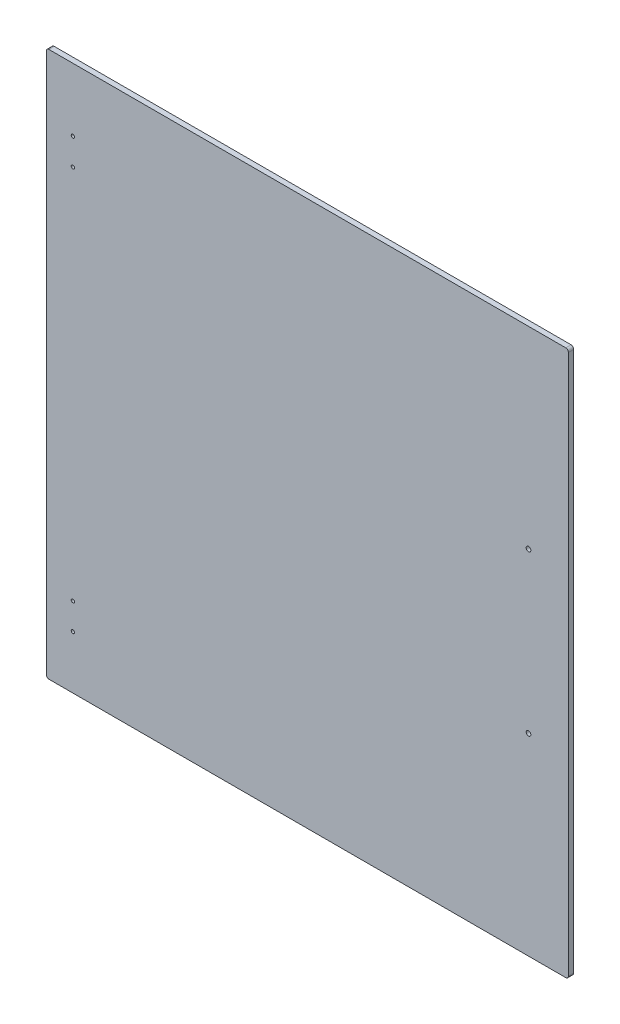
from build123d import *

# Parameters (mm, degrees)
SKIZZE1_W                        = 392.5
SKIZZE1_H                        = 410
AUFSATZ_LINEAR_AUSTRAGEN1_DEPTH  = 4
VERRUNDUNG1_R                    = 2
M3_GEWINDEBOHRUNG1_D             = 2.5
F_3_5_3_5_DURCHMESSER_BOHRUNG1_D = 3.5


with BuildPart() as part:
    # Skizze1 → Aufsatz-Linear austragen1 (new body)
    with BuildSketch(Plane.XY):
        Rectangle(SKIZZE1_W, SKIZZE1_H)
    extrude(amount=AUFSATZ_LINEAR_AUSTRAGEN1_DEPTH)

    # Verrundung1
    verrundung1_edges = [part.edges().sort_by_distance(p)[0] for p in [
        (196.25, -205, 2),
        (-196.25, -205, 2),
        (-196.25, 205, 2),
        (196.25, 205, 2),
    ]]
    fillet(verrundung1_edges, radius=VERRUNDUNG1_R)

    # M3 Gewindebohrung1 (through all)
    with Locations(Plane.XY.offset(4)):
        with Locations((-176.25, 157.5), (-176.25, 137.5), (-176.25, -145), (-176.25, -165)):
            Hole(M3_GEWINDEBOHRUNG1_D / 2)

    # 3.5 _3.5_ Durchmesser Bohrung1 (through all)
    with Locations(Plane.XY.offset(4)):
        with Locations((166.25, 60), (166.25, -60)):
            Hole(F_3_5_3_5_DURCHMESSER_BOHRUNG1_D / 2)


solid = part.part
